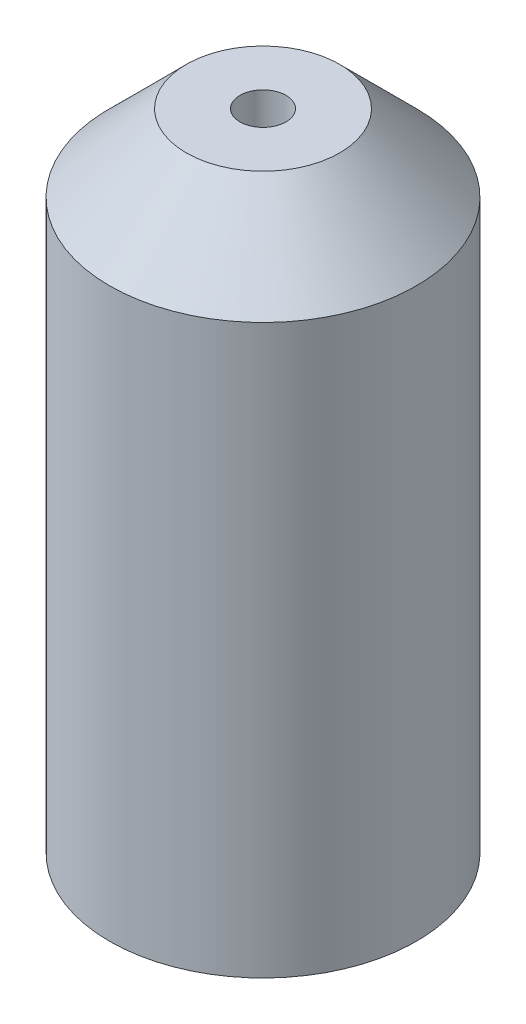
ISO-10303-21;
HEADER;
FILE_DESCRIPTION(('STEP AP214'),'2;1');
FILE_NAME('part.step','',(''),(''),'','','');
FILE_SCHEMA(('AUTOMOTIVE_DESIGN { 1 0 10303 214 1 1 1 1 }'));
ENDSEC;
DATA;
#1=APPLICATION_CONTEXT('core data for automotive mechanical design processes');
#2=APPLICATION_PROTOCOL_DEFINITION('international standard','automotive_design',2000,#1);
#3=PRODUCT_CONTEXT('',#1,'mechanical');
#4=PRODUCT('Part','Part','',(#3));
#5=PRODUCT_RELATED_PRODUCT_CATEGORY('part','',(#4));
#6=PRODUCT_DEFINITION_FORMATION('','',#4);
#7=PRODUCT_DEFINITION_CONTEXT('part definition',#1,'design');
#8=PRODUCT_DEFINITION('design','',#6,#7);
#9=PRODUCT_DEFINITION_SHAPE('','',#8);
#10=(LENGTH_UNIT() NAMED_UNIT(*) SI_UNIT(.MILLI.,.METRE.));
#11=(NAMED_UNIT(*) PLANE_ANGLE_UNIT() SI_UNIT($,.RADIAN.));
#12=(NAMED_UNIT(*) SI_UNIT($,.STERADIAN.) SOLID_ANGLE_UNIT());
#13=UNCERTAINTY_MEASURE_WITH_UNIT(LENGTH_MEASURE(1.E-05),#10,'distance_accuracy_value','');
#14=(GEOMETRIC_REPRESENTATION_CONTEXT(3) GLOBAL_UNCERTAINTY_ASSIGNED_CONTEXT((#13)) GLOBAL_UNIT_ASSIGNED_CONTEXT((#10,
#11,#12)) REPRESENTATION_CONTEXT('',''));
#15=CARTESIAN_POINT('',(0.,0.,0.));
#16=DIRECTION('',(0.,0.,1.));
#17=DIRECTION('',(1.,0.,0.));
#18=AXIS2_PLACEMENT_3D('',#15,#16,#17);
#19=CARTESIAN_POINT('',(175.,269.,0.));
#20=DIRECTION('',(0.,-1.,0.));
#21=DIRECTION('',(0.,0.,-1.));
#22=AXIS2_PLACEMENT_3D('',#19,#20,#21);
#23=CYLINDRICAL_SURFACE('',#22,10.);
#24=CARTESIAN_POINT('',(175.,264.,0.));
#25=DIRECTION('',(0.,1.,0.));
#26=DIRECTION('',(0.,0.,1.));
#27=AXIS2_PLACEMENT_3D('',#24,#25,#26);
#28=CIRCLE('',#27,10.);
#29=CARTESIAN_POINT('',(175.,264.,10.));
#30=VERTEX_POINT('',#29);
#31=EDGE_CURVE('E10',#30,#30,#28,.F.);
#32=ORIENTED_EDGE('',*,*,#31,.T.);
#33=EDGE_LOOP('',(#32));
#34=FACE_BOUND('',#33,.T.);
#35=CARTESIAN_POINT('',(175.,227.,0.));
#36=DIRECTION('',(0.,1.,0.));
#37=DIRECTION('',(0.,0.,1.));
#38=AXIS2_PLACEMENT_3D('',#35,#36,#37);
#39=CIRCLE('',#38,10.);
#40=CARTESIAN_POINT('',(175.,227.,10.));
#41=VERTEX_POINT('',#40);
#42=EDGE_CURVE('E51',#41,#41,#39,.T.);
#43=ORIENTED_EDGE('',*,*,#42,.T.);
#44=EDGE_LOOP('',(#43));
#45=FACE_BOUND('',#44,.T.);
#46=ADVANCED_FACE('F38',(#34,#45),#23,.T.);
#47=CARTESIAN_POINT('',(175.,269.,0.));
#48=DIRECTION('',(0.,1.,0.));
#49=DIRECTION('',(0.,0.,1.));
#50=AXIS2_PLACEMENT_3D('',#47,#48,#49);
#51=PLANE('',#50);
#52=CARTESIAN_POINT('',(175.,269.,0.));
#53=DIRECTION('',(0.,1.,0.));
#54=DIRECTION('',(0.,0.,1.));
#55=AXIS2_PLACEMENT_3D('',#52,#53,#54);
#56=CIRCLE('',#55,1.5);
#57=CARTESIAN_POINT('',(175.,269.,1.5));
#58=VERTEX_POINT('',#57);
#59=EDGE_CURVE('E59',#58,#58,#56,.T.);
#60=ORIENTED_EDGE('',*,*,#59,.F.);
#61=EDGE_LOOP('',(#60));
#62=FACE_BOUND('',#61,.T.);
#63=CARTESIAN_POINT('',(175.,269.,0.));
#64=DIRECTION('',(0.,1.,0.));
#65=DIRECTION('',(0.,0.,1.));
#66=AXIS2_PLACEMENT_3D('',#63,#64,#65);
#67=CIRCLE('',#66,5.);
#68=CARTESIAN_POINT('',(175.,269.,5.));
#69=VERTEX_POINT('',#68);
#70=EDGE_CURVE('E46',#69,#69,#67,.T.);
#71=ORIENTED_EDGE('',*,*,#70,.T.);
#72=EDGE_LOOP('',(#71));
#73=FACE_BOUND('',#72,.T.);
#74=ADVANCED_FACE('F88',(#62,#73),#51,.T.);
#75=CARTESIAN_POINT('',(175.,227.,0.));
#76=DIRECTION('',(0.,1.,0.));
#77=DIRECTION('',(0.,0.,1.));
#78=AXIS2_PLACEMENT_3D('',#75,#76,#77);
#79=PLANE('',#78);
#80=CARTESIAN_POINT('',(175.,227.,0.));
#81=DIRECTION('',(0.,1.,0.));
#82=DIRECTION('',(0.,0.,1.));
#83=AXIS2_PLACEMENT_3D('',#80,#81,#82);
#84=CIRCLE('',#83,1.59999999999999);
#85=CARTESIAN_POINT('',(175.,227.,1.59999999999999));
#86=VERTEX_POINT('',#85);
#87=EDGE_CURVE('E42',#86,#86,#84,.T.);
#88=ORIENTED_EDGE('',*,*,#87,.T.);
#89=EDGE_LOOP('',(#88));
#90=FACE_BOUND('',#89,.T.);
#91=ORIENTED_EDGE('',*,*,#42,.F.);
#92=EDGE_LOOP('',(#91));
#93=FACE_BOUND('',#92,.T.);
#94=ADVANCED_FACE('F40',(#90,#93),#79,.F.);
#95=CARTESIAN_POINT('',(175.,269.,0.));
#96=DIRECTION('',(0.,-1.,0.));
#97=DIRECTION('',(0.,0.,-1.));
#98=AXIS2_PLACEMENT_3D('',#95,#96,#97);
#99=CONICAL_SURFACE('',#98,5.,0.785398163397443);
#100=ORIENTED_EDGE('',*,*,#31,.F.);
#101=EDGE_LOOP('',(#100));
#102=FACE_BOUND('',#101,.T.);
#103=ORIENTED_EDGE('',*,*,#70,.F.);
#104=EDGE_LOOP('',(#103));
#105=FACE_BOUND('',#104,.T.);
#106=ADVANCED_FACE('F96',(#102,#105),#99,.T.);
#107=CARTESIAN_POINT('',(175.,249.,0.));
#108=DIRECTION('',(0.,1.,0.));
#109=DIRECTION('',(0.,0.,1.));
#110=AXIS2_PLACEMENT_3D('',#107,#108,#109);
#111=CYLINDRICAL_SURFACE('',#110,1.5);
#112=CARTESIAN_POINT('',(175.,249.,0.));
#113=DIRECTION('',(0.,1.,0.));
#114=DIRECTION('',(0.,0.,1.));
#115=AXIS2_PLACEMENT_3D('',#112,#113,#114);
#116=CIRCLE('',#115,1.5);
#117=CARTESIAN_POINT('',(175.,249.,1.5));
#118=VERTEX_POINT('',#117);
#119=EDGE_CURVE('E55',#118,#118,#116,.T.);
#120=ORIENTED_EDGE('',*,*,#119,.F.);
#121=EDGE_LOOP('',(#120));
#122=FACE_BOUND('',#121,.T.);
#123=ORIENTED_EDGE('',*,*,#59,.T.);
#124=EDGE_LOOP('',(#123));
#125=FACE_BOUND('',#124,.T.);
#126=ADVANCED_FACE('F85',(#122,#125),#111,.F.);
#127=CARTESIAN_POINT('',(175.,249.,0.));
#128=DIRECTION('',(0.,1.,0.));
#129=DIRECTION('',(0.,0.,1.));
#130=AXIS2_PLACEMENT_3D('',#127,#128,#129);
#131=PLANE('',#130);
#132=ORIENTED_EDGE('',*,*,#119,.T.);
#133=EDGE_LOOP('',(#132));
#134=FACE_BOUND('',#133,.T.);
#135=ADVANCED_FACE('F77',(#134),#131,.T.);
#136=CARTESIAN_POINT('',(175.,239.5,0.));
#137=DIRECTION('',(0.,1.,0.));
#138=DIRECTION('',(0.,0.,1.));
#139=AXIS2_PLACEMENT_3D('',#136,#137,#138);
#140=CYLINDRICAL_SURFACE('',#139,1.59999999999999);
#141=CARTESIAN_POINT('',(175.,239.5,0.));
#142=DIRECTION('',(0.,1.,0.));
#143=DIRECTION('',(0.,0.,1.));
#144=AXIS2_PLACEMENT_3D('',#141,#142,#143);
#145=CIRCLE('',#144,1.59999999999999);
#146=CARTESIAN_POINT('',(175.,239.5,1.59999999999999));
#147=VERTEX_POINT('',#146);
#148=EDGE_CURVE('E65',#147,#147,#145,.T.);
#149=ORIENTED_EDGE('',*,*,#148,.T.);
#150=EDGE_LOOP('',(#149));
#151=FACE_BOUND('',#150,.T.);
#152=ORIENTED_EDGE('',*,*,#87,.F.);
#153=EDGE_LOOP('',(#152));
#154=FACE_BOUND('',#153,.T.);
#155=ADVANCED_FACE('F74',(#151,#154),#140,.F.);
#156=CARTESIAN_POINT('',(176.6,239.5,0.));
#157=DIRECTION('',(0.,1.,0.));
#158=DIRECTION('',(0.,0.,1.));
#159=AXIS2_PLACEMENT_3D('',#156,#157,#158);
#160=PLANE('',#159);
#161=ORIENTED_EDGE('',*,*,#148,.F.);
#162=EDGE_LOOP('',(#161));
#163=FACE_BOUND('',#162,.T.);
#164=ADVANCED_FACE('F76',(#163),#160,.F.);
#165=CLOSED_SHELL('',(#46,#74,#94,#106,#126,#135,#155,#164));
#166=MANIFOLD_SOLID_BREP('B2',#165);
#167=ADVANCED_BREP_SHAPE_REPRESENTATION('',(#18,#166),#14);
#168=SHAPE_DEFINITION_REPRESENTATION(#9,#167);
ENDSEC;
END-ISO-10303-21;
